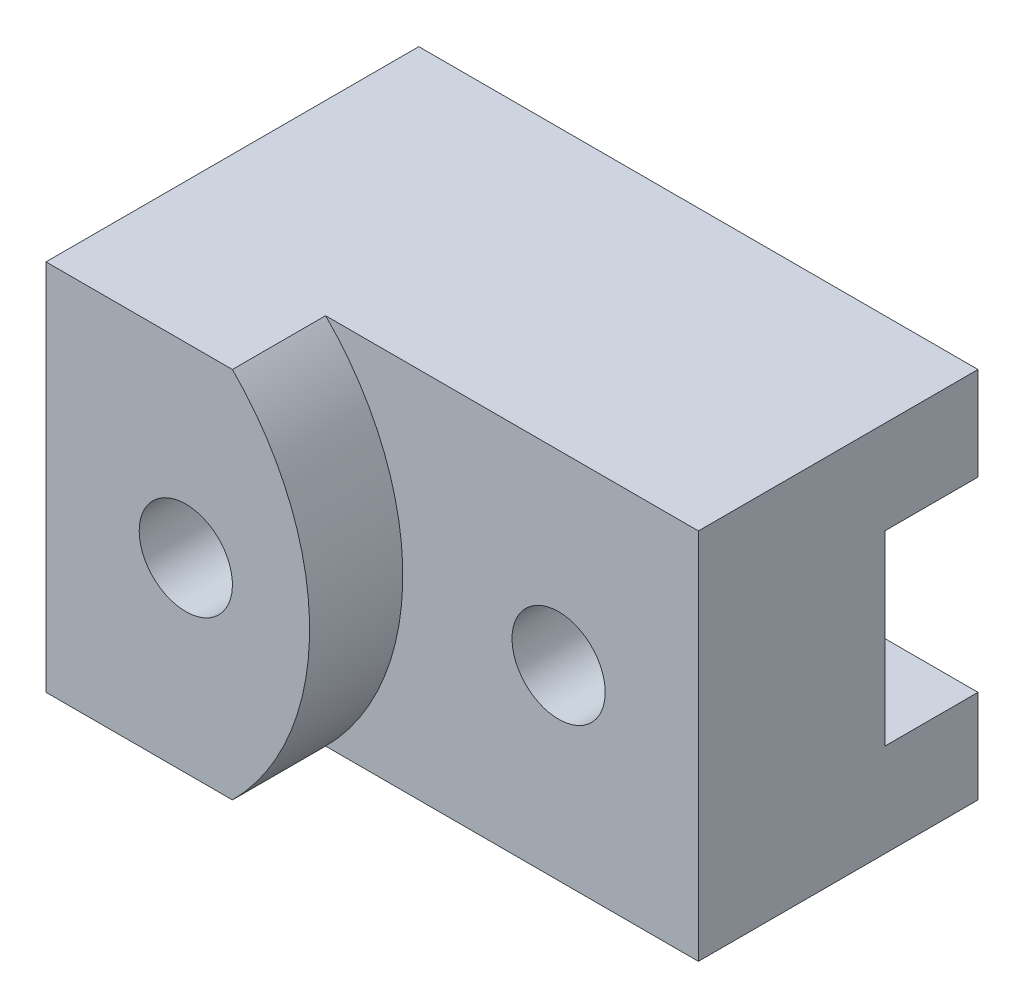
from build123d import *

# Parameters (mm, degrees)
BOSS_EXTRUDE1_DEPTH                                  = 152.4
CBORE_FOR_1_4_BINDING_HEAD_MACHINE_SCREW_D           = 25.4
CBORE_FOR_1_4_BINDING_HEAD_MACHINE_SCREW_CBORE_D     = 38.1
CBORE_FOR_1_4_BINDING_HEAD_MACHINE_SCREW_CBORE_DEPTH = 5.08
BOSS_EXTRUDE2_DEPTH                                  = 25.4
SKETCH5_R                                            = 12.7
CUT_EXTRUDE2_DEPTH                                   = 76.2


with BuildPart() as part:
    # Sketch1 → Boss-Extrude1 (new body)
    with BuildSketch(Plane(origin=(0, 0, 0), x_dir=(0, 0, -1), z_dir=(1, 0, 0))):
        Polygon((0, 101.6), (0, 0), (76.2, 0), (76.2, 25.4), (50.8, 25.4), (50.8, 76.2), (76.2, 76.2), (76.2, 101.6), align=None)
    extrude(amount=-BOSS_EXTRUDE1_DEPTH)

    # CBORE for 1_4 Binding Head Machine Screw (through all)
    with Locations(Plane(origin=(0, 0, -50.8), x_dir=(-1, 0, 0), z_dir=(0, 0, -1))):
        with Locations((38.1, 50.8)):
            CounterBoreHole(CBORE_FOR_1_4_BINDING_HEAD_MACHINE_SCREW_D / 2, CBORE_FOR_1_4_BINDING_HEAD_MACHINE_SCREW_CBORE_D / 2, CBORE_FOR_1_4_BINDING_HEAD_MACHINE_SCREW_CBORE_DEPTH)

    # Sketch6 → Boss-Extrude2 (add)
    with BuildSketch(Plane.XY):
        with BuildLine():
            Line((-152.4, 101.6), (-101.6, 101.6))
            ThreePointArc((-101.6, 101.6), (-80.557951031, 50.8), (-101.6, 0))
            Line((-101.6, 0), (-152.4, 0))
            Line((-152.4, 0), (-152.4, 101.6))
        make_face()
    extrude(amount=BOSS_EXTRUDE2_DEPTH)

    # Sketch5 → Cut-Extrude2 (cut)
    with BuildSketch(Plane(origin=(0, 0, -50.8), x_dir=(-1, 0, 0), z_dir=(0, 0, -1))):
        with Locations(Location((114.3, 50.8, 0), (0, 0, 90))):
            Circle(SKETCH5_R)
    extrude(amount=-CUT_EXTRUDE2_DEPTH, mode=Mode.SUBTRACT)


solid = part.part
